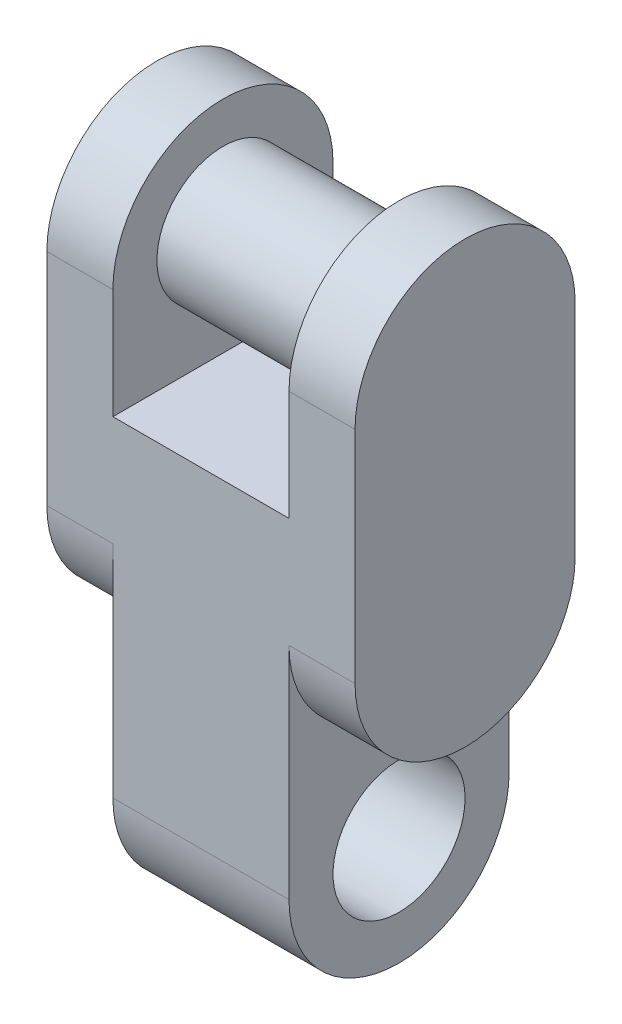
from build123d import *

# Parameters (mm, degrees)
BOSS_EXTRUDE1_DEPTH = 10
SKETCH2_R           = 3
CUT_EXTRUDE1_DEPTH  = 10
SKETCH3_R           = 3
BOSS_EXTRUDE2_DEPTH = 8
CUT_EXTRUDE2_DEPTH  = 26
CUT_EXTRUDE3_DEPTH  = 3
CUT_EXTRUDE4_START  = -3
CUT_EXTRUDE4_DEPTH  = 3


with BuildPart() as part:
    # Sketch1 → Boss-Extrude1 (new body)
    with BuildSketch(Plane.XY):
        Polygon((-36.892824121, -1.141503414), (-36.892824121, 8.858496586), (-33.892824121, 8.858496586), (-33.892824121, 28.858496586), (-36.892824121, 28.858496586), (-36.892824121, 18.858496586), (-44.892824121, 18.858496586), (-44.892824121, 28.858496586), (-47.892824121, 28.858496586), (-47.892824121, 8.858496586), (-44.892824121, 8.858496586), (-44.892824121, -1.141503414), (-40.892824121, -1.141503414), align=None)
    extrude(amount=BOSS_EXTRUDE1_DEPTH)

    # Sketch2 → Cut-Extrude1 (cut)
    with BuildSketch(Plane(origin=(-36.892824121, 0, 0), x_dir=(0, 0, -1), z_dir=(1, 0, 0))):
        with Locations((-5, 3.858496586)):
            Circle(SKETCH2_R)
        with BuildLine():
            ThreePointArc((-5, -1.141503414), (-8.535533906, 0.32296268), (-10, 3.858496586))
            Line((-10, 3.858496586), (-10, -1.141503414))
            Line((-10, -1.141503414), (-5, -1.141503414))
        make_face()
        with BuildLine():
            Line((0, -1.141503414), (0, 3.858496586))
            ThreePointArc((0, 3.858496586), (-1.464466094, 0.32296268), (-5, -1.141503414))
            Line((-5, -1.141503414), (0, -1.141503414))
        make_face()
    extrude(amount=-CUT_EXTRUDE1_DEPTH, mode=Mode.SUBTRACT)

    # Sketch3 → Boss-Extrude2 (add)
    with BuildSketch(Plane(origin=(-44.892824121, 0, 0), x_dir=(0, 0, -1), z_dir=(1, 0, 0))):
        with Locations((-5, 23.99481005)):
            Circle(SKETCH3_R)
    extrude(amount=BOSS_EXTRUDE2_DEPTH)

    # Sketch5 → Cut-Extrude2 (cut)
    with BuildSketch(Plane(origin=(-33.892824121, 0, 0), x_dir=(0, 0, -1), z_dir=(1, 0, 0))):
        with BuildLine():
            Line((-10, 28.858496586), (-10, 23.858496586))
            ThreePointArc((-10, 23.858496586), (-8.535533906, 27.394030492), (-5, 28.858496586))
            Line((-5, 28.858496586), (-10, 28.858496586))
        make_face()
        with BuildLine():
            ThreePointArc((-5, 28.858496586), (-1.464466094, 27.394030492), (0, 23.858496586))
            Line((0, 23.858496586), (0, 28.858496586))
            Line((0, 28.858496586), (-5, 28.858496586))
        make_face()
    extrude(amount=-CUT_EXTRUDE2_DEPTH, mode=Mode.SUBTRACT)

    # Sketch6 → Cut-Extrude3 (cut)
    with BuildSketch(Plane(origin=(-33.892824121, 0, 0), x_dir=(0, 0, -1), z_dir=(1, 0, 0))):
        with BuildLine():
            ThreePointArc((-5, 8.858496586), (-8.535533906, 10.32296268), (-10, 13.858496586))
            Line((-10, 13.858496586), (-10, 8.858496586))
            Line((-10, 8.858496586), (-5, 8.858496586))
        make_face()
        with BuildLine():
            Line((0, 8.858496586), (0, 13.858496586))
            ThreePointArc((0, 13.858496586), (-1.464466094, 10.32296268), (-5, 8.858496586))
            Line((-5, 8.858496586), (0, 8.858496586))
        make_face()
    extrude(amount=-CUT_EXTRUDE3_DEPTH, mode=Mode.SUBTRACT)

    # Sketch7 → Cut-Extrude4 (cut)
    with BuildSketch(Plane.ZY.offset(47.892824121).offset(CUT_EXTRUDE4_START)):
        with BuildLine():
            ThreePointArc((5, 8.858496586), (1.464466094, 10.32296268), (0, 13.858496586))
            Line((0, 13.858496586), (0, 8.858496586))
            Line((0, 8.858496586), (5, 8.858496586))
        make_face()
        with BuildLine():
            Line((10, 8.858496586), (10, 13.858496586))
            ThreePointArc((10, 13.858496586), (8.535533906, 10.32296268), (5, 8.858496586))
            Line((5, 8.858496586), (10, 8.858496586))
        make_face()
    extrude(amount=CUT_EXTRUDE4_DEPTH, mode=Mode.SUBTRACT)


solid = part.part
